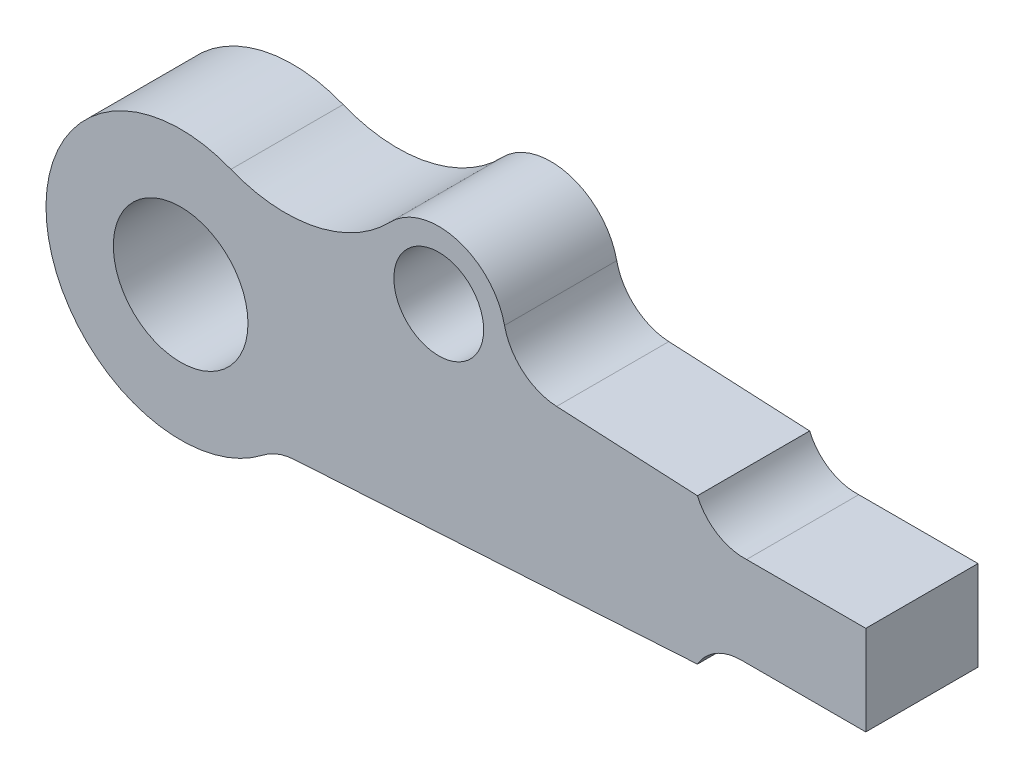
ISO-10303-21;
HEADER;
FILE_DESCRIPTION(('STEP AP214'),'2;1');
FILE_NAME('part.step','',(''),(''),'','','');
FILE_SCHEMA(('AUTOMOTIVE_DESIGN { 1 0 10303 214 1 1 1 1 }'));
ENDSEC;
DATA;
#1=APPLICATION_CONTEXT('core data for automotive mechanical design processes');
#2=APPLICATION_PROTOCOL_DEFINITION('international standard','automotive_design',2000,#1);
#3=PRODUCT_CONTEXT('',#1,'mechanical');
#4=PRODUCT('Part','Part','',(#3));
#5=PRODUCT_RELATED_PRODUCT_CATEGORY('part','',(#4));
#6=PRODUCT_DEFINITION_FORMATION('','',#4);
#7=PRODUCT_DEFINITION_CONTEXT('part definition',#1,'design');
#8=PRODUCT_DEFINITION('design','',#6,#7);
#9=PRODUCT_DEFINITION_SHAPE('','',#8);
#10=(LENGTH_UNIT() NAMED_UNIT(*) SI_UNIT(.MILLI.,.METRE.));
#11=(NAMED_UNIT(*) PLANE_ANGLE_UNIT() SI_UNIT($,.RADIAN.));
#12=(NAMED_UNIT(*) SI_UNIT($,.STERADIAN.) SOLID_ANGLE_UNIT());
#13=UNCERTAINTY_MEASURE_WITH_UNIT(LENGTH_MEASURE(1.E-05),#10,'distance_accuracy_value','');
#14=(GEOMETRIC_REPRESENTATION_CONTEXT(3) GLOBAL_UNCERTAINTY_ASSIGNED_CONTEXT((#13)) GLOBAL_UNIT_ASSIGNED_CONTEXT((#10,
#11,#12)) REPRESENTATION_CONTEXT('',''));
#15=CARTESIAN_POINT('',(0.,0.,0.));
#16=DIRECTION('',(0.,0.,1.));
#17=DIRECTION('',(1.,0.,0.));
#18=AXIS2_PLACEMENT_3D('',#15,#16,#17);
#19=CARTESIAN_POINT('',(857.178243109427,313.558700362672,-254.));
#20=DIRECTION('',(0.,0.,1.));
#21=DIRECTION('',(1.,0.,0.));
#22=AXIS2_PLACEMENT_3D('',#19,#20,#21);
#23=CYLINDRICAL_SURFACE('',#22,127.);
#24=CARTESIAN_POINT('',(857.178243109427,313.558700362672,0.));
#25=DIRECTION('',(0.,0.,1.));
#26=DIRECTION('',(1.,0.,0.));
#27=AXIS2_PLACEMENT_3D('',#24,#25,#26);
#28=CIRCLE('',#27,127.);
#29=CARTESIAN_POINT('',(733.097223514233,286.486563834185,0.));
#30=VERTEX_POINT('',#29);
#31=CARTESIAN_POINT('',(850.934157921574,186.712291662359,0.));
#32=VERTEX_POINT('',#31);
#33=EDGE_CURVE('E161',#30,#32,#28,.T.);
#34=ORIENTED_EDGE('',*,*,#33,.T.);
#35=DIRECTION('',(0.,0.,1.));
#36=VECTOR('',#35,1.);
#37=CARTESIAN_POINT('',(850.934157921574,186.712291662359,-254.));
#38=LINE('',#37,#36);
#39=CARTESIAN_POINT('',(850.934157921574,186.712291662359,-254.));
#40=VERTEX_POINT('',#39);
#41=EDGE_CURVE('E11',#40,#32,#38,.T.);
#42=ORIENTED_EDGE('',*,*,#41,.F.);
#43=CARTESIAN_POINT('',(857.178243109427,313.558700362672,-254.));
#44=DIRECTION('',(0.,0.,1.));
#45=DIRECTION('',(1.,0.,0.));
#46=AXIS2_PLACEMENT_3D('',#43,#44,#45);
#47=CIRCLE('',#46,127.);
#48=CARTESIAN_POINT('',(733.097223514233,286.486563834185,-254.));
#49=VERTEX_POINT('',#48);
#50=EDGE_CURVE('E196',#49,#40,#47,.T.);
#51=ORIENTED_EDGE('',*,*,#50,.F.);
#52=DIRECTION('',(0.,0.,1.));
#53=VECTOR('',#52,1.);
#54=CARTESIAN_POINT('',(733.097223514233,286.486563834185,-254.));
#55=LINE('',#54,#53);
#56=EDGE_CURVE('E36',#49,#30,#55,.T.);
#57=ORIENTED_EDGE('',*,*,#56,.T.);
#58=EDGE_LOOP('',(#34,#42,#51,#57));
#59=FACE_BOUND('',#58,.T.);
#60=ADVANCED_FACE('F33',(#59),#23,.F.);
#61=CARTESIAN_POINT('',(11.2257606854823,228.047405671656,-254.));
#62=DIRECTION('',(-0.0491660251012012,-0.998790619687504,0.));
#63=DIRECTION('',(0.998790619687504,-0.0491660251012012,0.));
#64=AXIS2_PLACEMENT_3D('',#61,#62,#63);
#65=PLANE('',#64);
#66=DIRECTION('',(0.998790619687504,-0.0491660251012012,0.));
#67=VECTOR('',#66,1.);
#68=CARTESIAN_POINT('',(11.2257606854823,228.047405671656,0.));
#69=LINE('',#68,#67);
#70=CARTESIAN_POINT('',(1169.76769506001,171.017533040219,0.));
#71=VERTEX_POINT('',#70);
#72=EDGE_CURVE('E88',#32,#71,#69,.T.);
#73=ORIENTED_EDGE('',*,*,#72,.T.);
#74=DIRECTION('',(0.,0.,1.));
#75=VECTOR('',#74,1.);
#76=CARTESIAN_POINT('',(1169.76769506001,171.017533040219,-254.));
#77=LINE('',#76,#75);
#78=CARTESIAN_POINT('',(1169.76769506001,171.017533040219,-254.));
#79=VERTEX_POINT('',#78);
#80=EDGE_CURVE('E42',#79,#71,#77,.T.);
#81=ORIENTED_EDGE('',*,*,#80,.F.);
#82=DIRECTION('',(0.998790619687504,-0.0491660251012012,0.));
#83=VECTOR('',#82,1.);
#84=CARTESIAN_POINT('',(11.2257606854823,228.047405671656,-254.));
#85=LINE('',#84,#83);
#86=EDGE_CURVE('E50',#40,#79,#85,.T.);
#87=ORIENTED_EDGE('',*,*,#86,.F.);
#88=ORIENTED_EDGE('',*,*,#41,.T.);
#89=EDGE_LOOP('',(#73,#81,#87,#88));
#90=FACE_BOUND('',#89,.T.);
#91=ADVANCED_FACE('F235',(#90),#65,.F.);
#92=CARTESIAN_POINT('',(1274.95296885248,215.745020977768,-254.));
#93=DIRECTION('',(0.,0.,1.));
#94=DIRECTION('',(1.,0.,0.));
#95=AXIS2_PLACEMENT_3D('',#92,#93,#94);
#96=CYLINDRICAL_SURFACE('',#95,114.3);
#97=CARTESIAN_POINT('',(1274.95296885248,215.745020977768,0.));
#98=DIRECTION('',(0.,0.,1.));
#99=DIRECTION('',(1.,0.,0.));
#100=AXIS2_PLACEMENT_3D('',#97,#98,#99);
#101=CIRCLE('',#100,114.3);
#102=CARTESIAN_POINT('',(1280.90311053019,101.6,0.));
#103=VERTEX_POINT('',#102);
#104=EDGE_CURVE('E141',#71,#103,#101,.T.);
#105=ORIENTED_EDGE('',*,*,#104,.T.);
#106=DIRECTION('',(0.,0.,1.));
#107=VECTOR('',#106,1.);
#108=CARTESIAN_POINT('',(1280.90311053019,101.6,-254.));
#109=LINE('',#108,#107);
#110=CARTESIAN_POINT('',(1280.90311053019,101.6,-254.));
#111=VERTEX_POINT('',#110);
#112=EDGE_CURVE('E139',#111,#103,#109,.T.);
#113=ORIENTED_EDGE('',*,*,#112,.F.);
#114=CARTESIAN_POINT('',(1274.95296885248,215.745020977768,-254.));
#115=DIRECTION('',(0.,0.,1.));
#116=DIRECTION('',(1.,0.,0.));
#117=AXIS2_PLACEMENT_3D('',#114,#115,#116);
#118=CIRCLE('',#117,114.3);
#119=EDGE_CURVE('E128',#79,#111,#118,.T.);
#120=ORIENTED_EDGE('',*,*,#119,.F.);
#121=ORIENTED_EDGE('',*,*,#80,.T.);
#122=EDGE_LOOP('',(#105,#113,#120,#121));
#123=FACE_BOUND('',#122,.T.);
#124=ADVANCED_FACE('F140',(#123),#96,.F.);
#125=CARTESIAN_POINT('',(0.,101.6,-254.));
#126=DIRECTION('',(0.,1.,0.));
#127=DIRECTION('',(-1.,0.,0.));
#128=AXIS2_PLACEMENT_3D('',#125,#126,#127);
#129=PLANE('',#128);
#130=DIRECTION('',(-1.,0.,0.));
#131=VECTOR('',#130,1.);
#132=CARTESIAN_POINT('',(0.,101.6,0.));
#133=LINE('',#132,#131);
#134=CARTESIAN_POINT('',(1550.76769506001,101.6,0.));
#135=VERTEX_POINT('',#134);
#136=EDGE_CURVE('E187',#135,#103,#133,.T.);
#137=ORIENTED_EDGE('',*,*,#136,.F.);
#138=DIRECTION('',(0.,0.,1.));
#139=VECTOR('',#138,1.);
#140=CARTESIAN_POINT('',(1550.76769506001,101.6,-254.));
#141=LINE('',#140,#139);
#142=CARTESIAN_POINT('',(1550.76769506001,101.6,-254.));
#143=VERTEX_POINT('',#142);
#144=EDGE_CURVE('E145',#143,#135,#141,.T.);
#145=ORIENTED_EDGE('',*,*,#144,.F.);
#146=DIRECTION('',(-1.,0.,0.));
#147=VECTOR('',#146,1.);
#148=CARTESIAN_POINT('',(0.,101.6,-254.));
#149=LINE('',#148,#147);
#150=EDGE_CURVE('E134',#143,#111,#149,.T.);
#151=ORIENTED_EDGE('',*,*,#150,.T.);
#152=ORIENTED_EDGE('',*,*,#112,.T.);
#153=EDGE_LOOP('',(#137,#145,#151,#152));
#154=FACE_BOUND('',#153,.T.);
#155=ADVANCED_FACE('F147',(#154),#129,.T.);
#156=CARTESIAN_POINT('',(1550.76769506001,0.,-254.));
#157=DIRECTION('',(1.,0.,0.));
#158=DIRECTION('',(0.,0.,-1.));
#159=AXIS2_PLACEMENT_3D('',#156,#157,#158);
#160=PLANE('',#159);
#161=DIRECTION('',(0.,1.,0.));
#162=VECTOR('',#161,1.);
#163=CARTESIAN_POINT('',(1550.76769506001,0.,0.));
#164=LINE('',#163,#162);
#165=CARTESIAN_POINT('',(1550.76769506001,-101.6,0.));
#166=VERTEX_POINT('',#165);
#167=EDGE_CURVE('E184',#166,#135,#164,.T.);
#168=ORIENTED_EDGE('',*,*,#167,.F.);
#169=DIRECTION('',(0.,0.,1.));
#170=VECTOR('',#169,1.);
#171=CARTESIAN_POINT('',(1550.76769506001,-101.6,-254.));
#172=LINE('',#171,#170);
#173=CARTESIAN_POINT('',(1550.76769506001,-101.6,-254.));
#174=VERTEX_POINT('',#173);
#175=EDGE_CURVE('E200',#174,#166,#172,.T.);
#176=ORIENTED_EDGE('',*,*,#175,.F.);
#177=DIRECTION('',(0.,1.,0.));
#178=VECTOR('',#177,1.);
#179=CARTESIAN_POINT('',(1550.76769506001,0.,-254.));
#180=LINE('',#179,#178);
#181=EDGE_CURVE('E148',#174,#143,#180,.T.);
#182=ORIENTED_EDGE('',*,*,#181,.T.);
#183=ORIENTED_EDGE('',*,*,#144,.T.);
#184=EDGE_LOOP('',(#168,#176,#182,#183));
#185=FACE_BOUND('',#184,.T.);
#186=ADVANCED_FACE('F247',(#185),#160,.T.);
#187=CARTESIAN_POINT('',(0.,-101.6,-254.));
#188=DIRECTION('',(0.,1.,0.));
#189=DIRECTION('',(-1.,0.,0.));
#190=AXIS2_PLACEMENT_3D('',#187,#188,#189);
#191=PLANE('',#190);
#192=DIRECTION('',(-1.,0.,0.));
#193=VECTOR('',#192,1.);
#194=CARTESIAN_POINT('',(0.,-101.6,0.));
#195=LINE('',#194,#193);
#196=CARTESIAN_POINT('',(1269.00282717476,-101.6,0.));
#197=VERTEX_POINT('',#196);
#198=EDGE_CURVE('E182',#166,#197,#195,.T.);
#199=ORIENTED_EDGE('',*,*,#198,.T.);
#200=DIRECTION('',(0.,0.,1.));
#201=VECTOR('',#200,1.);
#202=CARTESIAN_POINT('',(1269.00282717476,-101.6,-254.));
#203=LINE('',#202,#201);
#204=CARTESIAN_POINT('',(1269.00282717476,-101.6,-254.));
#205=VERTEX_POINT('',#204);
#206=EDGE_CURVE('E202',#205,#197,#203,.T.);
#207=ORIENTED_EDGE('',*,*,#206,.F.);
#208=DIRECTION('',(-1.,0.,0.));
#209=VECTOR('',#208,1.);
#210=CARTESIAN_POINT('',(0.,-101.6,-254.));
#211=LINE('',#210,#209);
#212=EDGE_CURVE('E150',#174,#205,#211,.T.);
#213=ORIENTED_EDGE('',*,*,#212,.F.);
#214=ORIENTED_EDGE('',*,*,#175,.T.);
#215=EDGE_LOOP('',(#199,#207,#213,#214));
#216=FACE_BOUND('',#215,.T.);
#217=ADVANCED_FACE('F250',(#216),#191,.F.);
#218=CARTESIAN_POINT('',(1269.00282717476,-215.9,-254.));
#219=DIRECTION('',(0.,0.,1.));
#220=DIRECTION('',(1.,0.,0.));
#221=AXIS2_PLACEMENT_3D('',#218,#219,#220);
#222=CYLINDRICAL_SURFACE('',#221,114.3);
#223=CARTESIAN_POINT('',(1269.00282717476,-215.9,0.));
#224=DIRECTION('',(0.,0.,1.));
#225=DIRECTION('',(1.,0.,0.));
#226=AXIS2_PLACEMENT_3D('',#223,#224,#225);
#227=CIRCLE('',#226,114.3);
#228=CARTESIAN_POINT('',(1169.76769506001,-159.182466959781,0.));
#229=VERTEX_POINT('',#228);
#230=EDGE_CURVE('E179',#197,#229,#227,.T.);
#231=ORIENTED_EDGE('',*,*,#230,.T.);
#232=DIRECTION('',(0.,0.,1.));
#233=VECTOR('',#232,1.);
#234=CARTESIAN_POINT('',(1169.76769506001,-159.182466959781,-254.));
#235=LINE('',#234,#233);
#236=CARTESIAN_POINT('',(1169.76769506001,-159.182466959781,-254.));
#237=VERTEX_POINT('',#236);
#238=EDGE_CURVE('E205',#237,#229,#235,.T.);
#239=ORIENTED_EDGE('',*,*,#238,.F.);
#240=CARTESIAN_POINT('',(1269.00282717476,-215.9,-254.));
#241=DIRECTION('',(0.,0.,1.));
#242=DIRECTION('',(1.,0.,0.));
#243=AXIS2_PLACEMENT_3D('',#240,#241,#242);
#244=CIRCLE('',#243,114.3);
#245=EDGE_CURVE('E293',#205,#237,#244,.T.);
#246=ORIENTED_EDGE('',*,*,#245,.F.);
#247=ORIENTED_EDGE('',*,*,#206,.T.);
#248=EDGE_LOOP('',(#231,#239,#246,#247));
#249=FACE_BOUND('',#248,.T.);
#250=ADVANCED_FACE('F254',(#249),#222,.F.);
#251=CARTESIAN_POINT('',(13.8351506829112,-229.014342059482,-254.));
#252=DIRECTION('',(0.060301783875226,-0.998180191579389,0.));
#253=DIRECTION('',(0.998180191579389,0.060301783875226,0.));
#254=AXIS2_PLACEMENT_3D('',#251,#252,#253);
#255=PLANE('',#254);
#256=DIRECTION('',(0.998180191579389,0.060301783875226,0.));
#257=VECTOR('',#256,1.);
#258=CARTESIAN_POINT('',(13.8351506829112,-229.014342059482,0.));
#259=LINE('',#258,#257);
#260=CARTESIAN_POINT('',(257.128270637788,-214.316585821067,0.));
#261=VERTEX_POINT('',#260);
#262=EDGE_CURVE('E176',#261,#229,#259,.T.);
#263=ORIENTED_EDGE('',*,*,#262,.F.);
#264=DIRECTION('',(0.,0.,1.));
#265=VECTOR('',#264,1.);
#266=CARTESIAN_POINT('',(257.128270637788,-214.316585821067,-254.));
#267=LINE('',#266,#265);
#268=CARTESIAN_POINT('',(257.128270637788,-214.316585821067,-254.));
#269=VERTEX_POINT('',#268);
#270=EDGE_CURVE('E207',#269,#261,#267,.T.);
#271=ORIENTED_EDGE('',*,*,#270,.F.);
#272=DIRECTION('',(0.998180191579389,0.060301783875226,0.));
#273=VECTOR('',#272,1.);
#274=CARTESIAN_POINT('',(13.8351506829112,-229.014342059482,-254.));
#275=LINE('',#274,#273);
#276=EDGE_CURVE('E287',#269,#237,#275,.T.);
#277=ORIENTED_EDGE('',*,*,#276,.T.);
#278=ORIENTED_EDGE('',*,*,#238,.T.);
#279=EDGE_LOOP('',(#263,#271,#277,#278));
#280=FACE_BOUND('',#279,.T.);
#281=ADVANCED_FACE('F258',(#280),#255,.T.);
#282=CARTESIAN_POINT('',(264.786597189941,-341.08547015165,-254.));
#283=DIRECTION('',(0.,0.,1.));
#284=DIRECTION('',(1.,0.,0.));
#285=AXIS2_PLACEMENT_3D('',#282,#283,#284);
#286=CYLINDRICAL_SURFACE('',#285,127.);
#287=CARTESIAN_POINT('',(264.786597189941,-341.08547015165,0.));
#288=DIRECTION('',(0.,0.,1.));
#289=DIRECTION('',(1.,0.,0.));
#290=AXIS2_PLACEMENT_3D('',#287,#288,#289);
#291=CIRCLE('',#290,127.);
#292=CARTESIAN_POINT('',(186.908186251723,-240.766214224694,0.));
#293=VERTEX_POINT('',#292);
#294=EDGE_CURVE('E173',#261,#293,#291,.T.);
#295=ORIENTED_EDGE('',*,*,#294,.T.);
#296=DIRECTION('',(0.,0.,1.));
#297=VECTOR('',#296,1.);
#298=CARTESIAN_POINT('',(186.908186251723,-240.766214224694,-254.));
#299=LINE('',#298,#297);
#300=CARTESIAN_POINT('',(186.908186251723,-240.766214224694,-254.));
#301=VERTEX_POINT('',#300);
#302=EDGE_CURVE('E209',#301,#293,#299,.T.);
#303=ORIENTED_EDGE('',*,*,#302,.F.);
#304=CARTESIAN_POINT('',(264.786597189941,-341.08547015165,-254.));
#305=DIRECTION('',(0.,0.,1.));
#306=DIRECTION('',(1.,0.,0.));
#307=AXIS2_PLACEMENT_3D('',#304,#305,#306);
#308=CIRCLE('',#307,127.);
#309=EDGE_CURVE('E295',#269,#301,#308,.T.);
#310=ORIENTED_EDGE('',*,*,#309,.F.);
#311=ORIENTED_EDGE('',*,*,#270,.T.);
#312=EDGE_LOOP('',(#295,#303,#310,#311));
#313=FACE_BOUND('',#312,.T.);
#314=ADVANCED_FACE('F262',(#313),#286,.F.);
#315=CARTESIAN_POINT('',(0.,0.,-254.));
#316=DIRECTION('',(0.,0.,1.));
#317=DIRECTION('',(1.,0.,0.));
#318=AXIS2_PLACEMENT_3D('',#315,#316,#317);
#319=CYLINDRICAL_SURFACE('',#318,304.8);
#320=CARTESIAN_POINT('',(0.,0.,0.));
#321=DIRECTION('',(0.,0.,1.));
#322=DIRECTION('',(1.,0.,0.));
#323=AXIS2_PLACEMENT_3D('',#320,#321,#322);
#324=CIRCLE('',#323,304.8);
#325=CARTESIAN_POINT('',(113.733546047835,282.785644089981,0.));
#326=VERTEX_POINT('',#325);
#327=EDGE_CURVE('E170',#326,#293,#324,.T.);
#328=ORIENTED_EDGE('',*,*,#327,.F.);
#329=DIRECTION('',(0.,0.,1.));
#330=VECTOR('',#329,1.);
#331=CARTESIAN_POINT('',(113.733546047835,282.785644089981,-254.));
#332=LINE('',#331,#330);
#333=CARTESIAN_POINT('',(113.733546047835,282.785644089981,-254.));
#334=VERTEX_POINT('',#333);
#335=EDGE_CURVE('E211',#334,#326,#332,.T.);
#336=ORIENTED_EDGE('',*,*,#335,.F.);
#337=CARTESIAN_POINT('',(0.,0.,-254.));
#338=DIRECTION('',(0.,0.,1.));
#339=DIRECTION('',(1.,0.,0.));
#340=AXIS2_PLACEMENT_3D('',#337,#338,#339);
#341=CIRCLE('',#340,304.8);
#342=EDGE_CURVE('E280',#334,#301,#341,.T.);
#343=ORIENTED_EDGE('',*,*,#342,.T.);
#344=ORIENTED_EDGE('',*,*,#302,.T.);
#345=EDGE_LOOP('',(#328,#336,#343,#344));
#346=FACE_BOUND('',#345,.T.);
#347=ADVANCED_FACE('F266',(#346),#319,.T.);
#348=CARTESIAN_POINT('',(236.944887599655,589.136758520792,-254.));
#349=DIRECTION('',(0.,0.,1.));
#350=DIRECTION('',(1.,0.,0.));
#351=AXIS2_PLACEMENT_3D('',#348,#349,#350);
#352=CYLINDRICAL_SURFACE('',#351,330.2);
#353=CARTESIAN_POINT('',(236.944887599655,589.136758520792,0.));
#354=DIRECTION('',(0.,0.,1.));
#355=DIRECTION('',(1.,0.,0.));
#356=AXIS2_PLACEMENT_3D('',#353,#354,#355);
#357=CIRCLE('',#356,330.2);
#358=CARTESIAN_POINT('',(474.540490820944,359.832660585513,0.));
#359=VERTEX_POINT('',#358);
#360=EDGE_CURVE('E167',#326,#359,#357,.T.);
#361=ORIENTED_EDGE('',*,*,#360,.T.);
#362=DIRECTION('',(0.,0.,1.));
#363=VECTOR('',#362,1.);
#364=CARTESIAN_POINT('',(474.540490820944,359.832660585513,-254.));
#365=LINE('',#364,#363);
#366=CARTESIAN_POINT('',(474.540490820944,359.832660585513,-254.));
#367=VERTEX_POINT('',#366);
#368=EDGE_CURVE('E212',#367,#359,#365,.T.);
#369=ORIENTED_EDGE('',*,*,#368,.F.);
#370=CARTESIAN_POINT('',(236.944887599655,589.136758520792,-254.));
#371=DIRECTION('',(0.,0.,1.));
#372=DIRECTION('',(1.,0.,0.));
#373=AXIS2_PLACEMENT_3D('',#370,#371,#372);
#374=CIRCLE('',#373,330.2);
#375=EDGE_CURVE('E300',#334,#367,#374,.T.);
#376=ORIENTED_EDGE('',*,*,#375,.F.);
#377=ORIENTED_EDGE('',*,*,#335,.T.);
#378=EDGE_LOOP('',(#361,#369,#376,#377));
#379=FACE_BOUND('',#378,.T.);
#380=ADVANCED_FACE('F230',(#379),#352,.F.);
#381=CARTESIAN_POINT('',(0.,0.,-254.));
#382=DIRECTION('',(0.,0.,1.));
#383=DIRECTION('',(1.,0.,0.));
#384=AXIS2_PLACEMENT_3D('',#381,#382,#383);
#385=CYLINDRICAL_SURFACE('',#384,152.4);
#386=CARTESIAN_POINT('',(0.,0.,-254.));
#387=DIRECTION('',(0.,0.,1.));
#388=DIRECTION('',(1.,0.,0.));
#389=AXIS2_PLACEMENT_3D('',#386,#387,#388);
#390=CIRCLE('',#389,152.4);
#391=CARTESIAN_POINT('',(152.4,0.,-254.));
#392=VERTEX_POINT('',#391);
#393=EDGE_CURVE('E155',#392,#392,#390,.T.);
#394=ORIENTED_EDGE('',*,*,#393,.F.);
#395=EDGE_LOOP('',(#394));
#396=FACE_BOUND('',#395,.T.);
#397=CARTESIAN_POINT('',(0.,0.,0.));
#398=DIRECTION('',(0.,0.,1.));
#399=DIRECTION('',(1.,0.,0.));
#400=AXIS2_PLACEMENT_3D('',#397,#398,#399);
#401=CIRCLE('',#400,152.4);
#402=CARTESIAN_POINT('',(152.4,0.,0.));
#403=VERTEX_POINT('',#402);
#404=EDGE_CURVE('E191',#403,#403,#401,.T.);
#405=ORIENTED_EDGE('',*,*,#404,.T.);
#406=EDGE_LOOP('',(#405));
#407=FACE_BOUND('',#406,.T.);
#408=ADVANCED_FACE('F223',(#396,#407),#385,.F.);
#409=CARTESIAN_POINT('',(584.2,254.,-254.));
#410=DIRECTION('',(0.,0.,1.));
#411=DIRECTION('',(1.,0.,0.));
#412=AXIS2_PLACEMENT_3D('',#409,#410,#411);
#413=CYLINDRICAL_SURFACE('',#412,152.4);
#414=CARTESIAN_POINT('',(584.2,254.,0.));
#415=DIRECTION('',(0.,0.,1.));
#416=DIRECTION('',(1.,0.,0.));
#417=AXIS2_PLACEMENT_3D('',#414,#415,#416);
#418=CIRCLE('',#417,152.4);
#419=EDGE_CURVE('E164',#30,#359,#418,.T.);
#420=ORIENTED_EDGE('',*,*,#419,.F.);
#421=ORIENTED_EDGE('',*,*,#56,.F.);
#422=CARTESIAN_POINT('',(584.2,254.,-254.));
#423=DIRECTION('',(0.,0.,1.));
#424=DIRECTION('',(1.,0.,0.));
#425=AXIS2_PLACEMENT_3D('',#422,#423,#424);
#426=CIRCLE('',#425,152.4);
#427=EDGE_CURVE('E302',#49,#367,#426,.T.);
#428=ORIENTED_EDGE('',*,*,#427,.T.);
#429=ORIENTED_EDGE('',*,*,#368,.T.);
#430=EDGE_LOOP('',(#420,#421,#428,#429));
#431=FACE_BOUND('',#430,.T.);
#432=ADVANCED_FACE('F220',(#431),#413,.T.);
#433=CARTESIAN_POINT('',(584.2,254.,-254.));
#434=DIRECTION('',(0.,0.,1.));
#435=DIRECTION('',(1.,0.,0.));
#436=AXIS2_PLACEMENT_3D('',#433,#434,#435);
#437=CYLINDRICAL_SURFACE('',#436,101.6);
#438=CARTESIAN_POINT('',(584.2,254.,-254.));
#439=DIRECTION('',(0.,0.,1.));
#440=DIRECTION('',(1.,0.,0.));
#441=AXIS2_PLACEMENT_3D('',#438,#439,#440);
#442=CIRCLE('',#441,101.6);
#443=CARTESIAN_POINT('',(685.8,254.,-254.));
#444=VERTEX_POINT('',#443);
#445=EDGE_CURVE('E158',#444,#444,#442,.T.);
#446=ORIENTED_EDGE('',*,*,#445,.F.);
#447=EDGE_LOOP('',(#446));
#448=FACE_BOUND('',#447,.T.);
#449=CARTESIAN_POINT('',(584.2,254.,0.));
#450=DIRECTION('',(0.,0.,1.));
#451=DIRECTION('',(1.,0.,0.));
#452=AXIS2_PLACEMENT_3D('',#449,#450,#451);
#453=CIRCLE('',#452,101.6);
#454=CARTESIAN_POINT('',(685.8,254.,0.));
#455=VERTEX_POINT('',#454);
#456=EDGE_CURVE('E194',#455,#455,#453,.T.);
#457=ORIENTED_EDGE('',*,*,#456,.T.);
#458=EDGE_LOOP('',(#457));
#459=FACE_BOUND('',#458,.T.);
#460=ADVANCED_FACE('F222',(#448,#459),#437,.F.);
#461=CARTESIAN_POINT('',(0.,0.,-254.));
#462=DIRECTION('',(0.,0.,1.));
#463=DIRECTION('',(1.,0.,0.));
#464=AXIS2_PLACEMENT_3D('',#461,#462,#463);
#465=PLANE('',#464);
#466=ORIENTED_EDGE('',*,*,#50,.T.);
#467=ORIENTED_EDGE('',*,*,#86,.T.);
#468=ORIENTED_EDGE('',*,*,#119,.T.);
#469=ORIENTED_EDGE('',*,*,#150,.F.);
#470=ORIENTED_EDGE('',*,*,#181,.F.);
#471=ORIENTED_EDGE('',*,*,#212,.T.);
#472=ORIENTED_EDGE('',*,*,#245,.T.);
#473=ORIENTED_EDGE('',*,*,#276,.F.);
#474=ORIENTED_EDGE('',*,*,#309,.T.);
#475=ORIENTED_EDGE('',*,*,#342,.F.);
#476=ORIENTED_EDGE('',*,*,#375,.T.);
#477=ORIENTED_EDGE('',*,*,#427,.F.);
#478=EDGE_LOOP('',(#466,#467,#468,#469,#470,#471,#472,#473,#474,#475,#476,#477));
#479=FACE_BOUND('',#478,.T.);
#480=ORIENTED_EDGE('',*,*,#393,.T.);
#481=EDGE_LOOP('',(#480));
#482=FACE_BOUND('',#481,.T.);
#483=ORIENTED_EDGE('',*,*,#445,.T.);
#484=EDGE_LOOP('',(#483));
#485=FACE_BOUND('',#484,.T.);
#486=ADVANCED_FACE('F130',(#479,#482,#485),#465,.F.);
#487=CARTESIAN_POINT('',(0.,0.,0.));
#488=DIRECTION('',(0.,0.,1.));
#489=DIRECTION('',(1.,0.,0.));
#490=AXIS2_PLACEMENT_3D('',#487,#488,#489);
#491=PLANE('',#490);
#492=ORIENTED_EDGE('',*,*,#33,.F.);
#493=ORIENTED_EDGE('',*,*,#419,.T.);
#494=ORIENTED_EDGE('',*,*,#360,.F.);
#495=ORIENTED_EDGE('',*,*,#327,.T.);
#496=ORIENTED_EDGE('',*,*,#294,.F.);
#497=ORIENTED_EDGE('',*,*,#262,.T.);
#498=ORIENTED_EDGE('',*,*,#230,.F.);
#499=ORIENTED_EDGE('',*,*,#198,.F.);
#500=ORIENTED_EDGE('',*,*,#167,.T.);
#501=ORIENTED_EDGE('',*,*,#136,.T.);
#502=ORIENTED_EDGE('',*,*,#104,.F.);
#503=ORIENTED_EDGE('',*,*,#72,.F.);
#504=EDGE_LOOP('',(#492,#493,#494,#495,#496,#497,#498,#499,#500,#501,#502,#503));
#505=FACE_BOUND('',#504,.T.);
#506=ORIENTED_EDGE('',*,*,#404,.F.);
#507=EDGE_LOOP('',(#506));
#508=FACE_BOUND('',#507,.T.);
#509=ORIENTED_EDGE('',*,*,#456,.F.);
#510=EDGE_LOOP('',(#509));
#511=FACE_BOUND('',#510,.T.);
#512=ADVANCED_FACE('F217',(#505,#508,#511),#491,.T.);
#513=CLOSED_SHELL('',(#60,#91,#124,#155,#186,#217,#250,#281,#314,#347,#380,#408,#432,#460,#486,#512));
#514=MANIFOLD_SOLID_BREP('B2',#513);
#515=ADVANCED_BREP_SHAPE_REPRESENTATION('',(#18,#514),#14);
#516=SHAPE_DEFINITION_REPRESENTATION(#9,#515);
ENDSEC;
END-ISO-10303-21;
